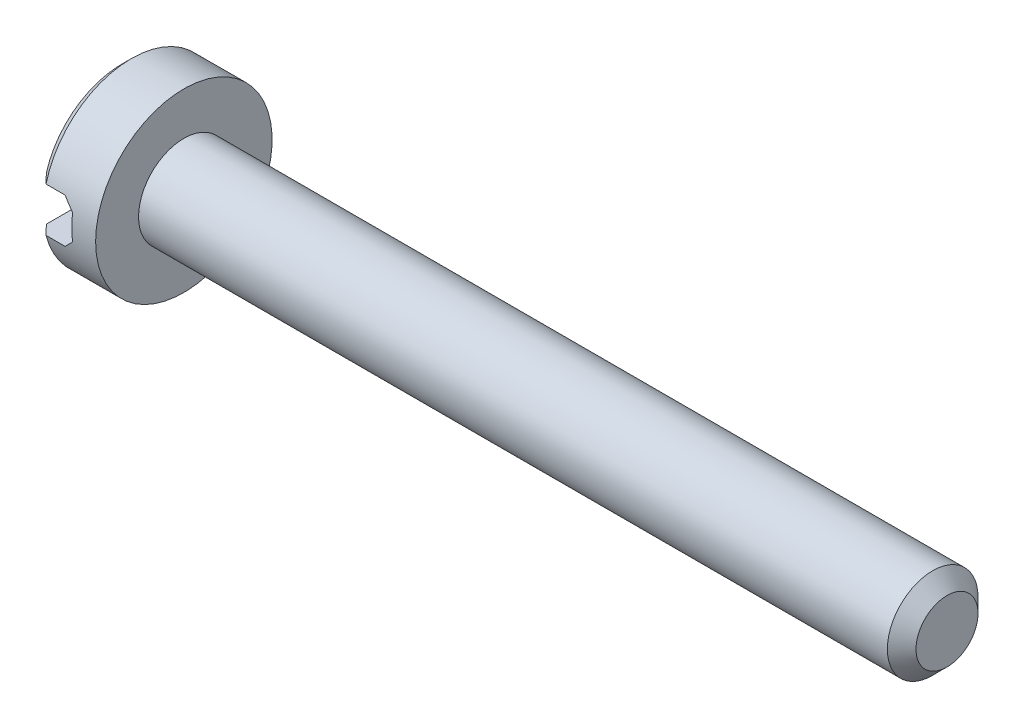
from build123d import *

# Parameters (mm, degrees)
ENL_V_MAT_EXTRU_1_DEPTH = 5
ESQUISSE3_R             = 0.95
EXTRUSION1_DEPTH        = 16
CHANFREIN1_SIZE         = 0.3


with BuildPart() as part:
    # Esquisse1 → R_volution1 (revolve)
    with BuildSketch(Plane.XY, mode=Mode.PRIVATE) as r_volution1_sk:
        Polygon((0, 0), (0, 1.65), (0.2, 1.85), (1.3, 1.85), (1.3, 0), align=None)
    revolve(r_volution1_sk.sketch.rotate(Axis((0, 0, 0), (1, 0, 0)), 90), axis=Axis((0, 0, 0), (1, 0, 0)))

    # Esquisse2 → Enl_v. mat.-Extru.1 (cut, symmetric)
    with BuildSketch(Plane.XY):
        Polygon((0, 0.465549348), (0.6, 0.465549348), (0.8, 0.265549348), (0.8, -0.265549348), (0.6, -0.465549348), (0, -0.465549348), align=None)
    extrude(amount=ENL_V_MAT_EXTRU_1_DEPTH, both=True, mode=Mode.SUBTRACT)

    # Esquisse3 → Extrusion1 (add)
    with BuildSketch(Plane(origin=(1.3, 0, 0), x_dir=(0, 0, -1), z_dir=(1, 0, 0))):
        with Locations(Location((0, 0, 0), (0, 0, 180))):
            Circle(ESQUISSE3_R)
    extrude(amount=EXTRUSION1_DEPTH)

    # Chanfrein1
    chanfrein1_edges = [part.edges().sort_by_distance(p)[0] for p in [
        (17.3, 0, -0.95),
    ]]
    chamfer(chanfrein1_edges, length=CHANFREIN1_SIZE)


solid = part.part
